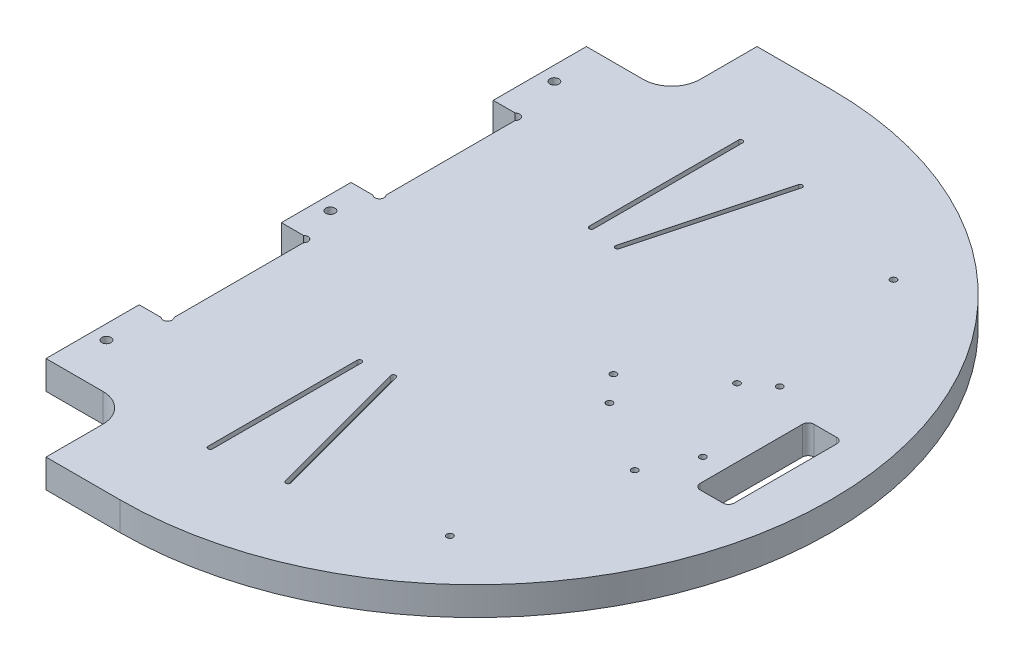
from build123d import *

# Parameters (mm, degrees)
ESQUISSE1_R             = 1.1
ESQUISSE1_R_2           = 1.6
EXTRUSION1_DEPTH        = 10
ESQUISSE2_R             = 1.1
ENL_V_MAT_EXTRU_1_DEPTH = 2


with BuildPart() as part:
    # Esquisse1 → Extrusion1 (new body)
    with BuildSketch(Plane(origin=(0, 0, 0), x_dir=(1, 0, 0), z_dir=(0, 1, 0))):
        with BuildLine():
            Line((50, 125), (24, 125))
            Line((24, 125), (24, 105))
            ThreePointArc((24, 105), (21.071067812, 97.928932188), (14, 95))
            Line((14, 95), (-6, 95))
            Line((-6, 95), (-6, 62.25))
            Line((-6, 62.25), (1.7372583, 62.25))
            ThreePointArc((1.7372583, 62.25), (4, 62.25), (4, 59.9872583))
            Line((4, 59.9872583), (4, 14.5127417))
            ThreePointArc((4, 14.5127417), (4, 12.25), (1.7372583, 12.25))
            Line((1.7372583, 12.25), (-6, 12.25))
            Line((-6, 12.25), (-6, -12.25))
            Line((-6, -12.25), (1.7372583, -12.25))
            ThreePointArc((1.7372583, -12.25), (4, -12.25), (4, -14.5127417))
            Line((4, -14.5127417), (4, -59.9872583))
            ThreePointArc((4, -59.9872583), (4, -62.25), (1.7372583, -62.25))
            Line((1.7372583, -62.25), (-6, -62.25))
            Line((-6, -62.25), (-6, -95))
            Line((-6, -95), (14, -95))
            ThreePointArc((14, -95), (21.071067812, -97.928932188), (24, -105))
            Line((24, -105), (24, -125))
            Line((24, -125), (50, -125))
            ThreePointArc((50, -125), (175, 0), (50, 125))
        make_face()
        with Locations(Location((123, 18.949784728, 0), (0, 0, 270))):
            Circle(ESQUISSE1_R, mode=Mode.SUBTRACT)
        with Locations(Location((139.410994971, -9.474892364, 0), (0, 0, 270))):
            Circle(ESQUISSE1_R, mode=Mode.SUBTRACT)
        with Locations(Location((106.589005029, -9.474892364, 0), (0, 0, 270))):
            Circle(ESQUISSE1_R, mode=Mode.SUBTRACT)
        with Locations(Location((-1, 78.75, 0), (0, 0, 270))):
            Circle(ESQUISSE1_R_2, mode=Mode.SUBTRACT)
        with Locations(Location((-1, -78.75, 0), (0, 0, 90))):
            Circle(ESQUISSE1_R_2, mode=Mode.SUBTRACT)
        with Locations(Location((-1, 0, 0), (0, 0, 270))):
            Circle(ESQUISSE1_R_2, mode=Mode.SUBTRACT)
        with BuildLine():
            Line((149, 20), (157, 20))
            ThreePointArc((157, 20), (158.414213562, 19.414213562), (159, 18))
            Line((159, 18), (159, -18))
            ThreePointArc((159, -18), (158.414213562, -19.414213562), (157, -20))
            Line((157, -20), (149, -20))
            ThreePointArc((149, -20), (147.585786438, -19.414213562), (147, -18))
            Line((147, -18), (147, 18))
            ThreePointArc((147, 18), (147.585786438, 19.414213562), (149, 20))
        make_face(mode=Mode.SUBTRACT)
    extrude(amount=EXTRUSION1_DEPTH)

    # Esquisse2 → Enl_v. mat.-Extru.1 (cut)
    with BuildSketch(Plane.XZ.offset(-10)):
        with Locations(Location((98.5, 0, 0), (0, 0, 270))):
            Circle(ESQUISSE2_R)
        with Locations(Location((119, 78, 0), (0, 0, 270))):
            Circle(ESQUISSE2_R)
        with Locations(Location((119, -78, 0), (0, 0, 90))):
            Circle(ESQUISSE2_R)
        with Locations(Location((131.5, -25.5, 0), (0, 0, 270))):
            Circle(ESQUISSE2_R)
        with Locations(Location((131.5, 25.5, 0), (0, 0, 90))):
            Circle(ESQUISSE2_R)
        with BuildLine():
            Line((59.787078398, -39.61682845), (73.349198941, -90.231341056))
            ThreePointArc((73.349198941, -90.231341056), (74.328994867, -90.797026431), (74.894680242, -89.817230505))
            Line((74.894680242, -89.817230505), (61.332559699, -39.202717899))
            ThreePointArc((61.332559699, -39.202717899), (60.352763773, -38.637032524), (59.787078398, -39.61682845))
        make_face()
        with BuildLine():
            Line((61.332555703, 39.202719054), (74.894671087, 89.817233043))
            ThreePointArc((74.894671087, 89.817233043), (74.328985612, 90.797028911), (73.349189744, 90.231343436))
            Line((73.349189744, 90.231343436), (59.78707436, 39.616829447))
            ThreePointArc((59.78707436, 39.616829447), (60.352759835, 38.637033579), (61.332555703, 39.202719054))
        make_face()
        with BuildLine():
            Line((50.799997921, 40.800000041), (50.79999525, 93.200000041))
            ThreePointArc((50.79999525, 93.200000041), (49.99999521, 94), (49.19999525, 93.199999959))
            Line((49.19999525, 93.199999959), (49.199997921, 40.799999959))
            ThreePointArc((49.199997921, 40.799999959), (49.999997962, 40), (50.799997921, 40.800000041))
        make_face()
        with BuildLine():
            Line((49.200002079, -40.800000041), (49.20000475, -93.200000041))
            ThreePointArc((49.20000475, -93.200000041), (50.00000479, -94), (50.80000475, -93.199999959))
            Line((50.80000475, -93.199999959), (50.800002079, -40.799999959))
            ThreePointArc((50.800002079, -40.799999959), (50.000002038, -40), (49.200002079, -40.800000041))
        make_face()
    extrude(amount=ENL_V_MAT_EXTRU_1_DEPTH, mode=Mode.SUBTRACT)


solid = part.part
